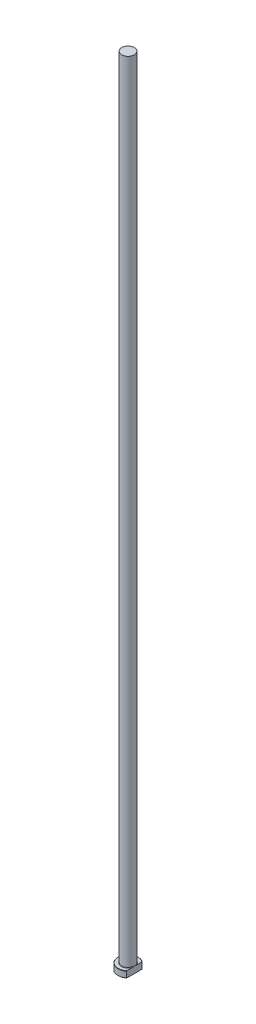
from build123d import *
from build123d.topology import SkipClean

# Parameters (mm, degrees)
CHAMFER1_SIZE = 0.2
FILLET1_R     = 0.3
KEY_DEPTH     = 631.101579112


with BuildPart() as part:
    # Sketch1 → Revolve1 (revolve)
    with BuildSketch(Plane.XY, mode=Mode.PRIVATE) as revolve1_sk:
        Polygon((0, 0), (-8, 0), (-8, 5), (-5, 5), (-5, 630), (0, 630), align=None)
    revolve(revolve1_sk.sketch.rotate(Axis((0, 259.958771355, 0), (0, -1, 0)), 270), axis=Axis((0, 259.958771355, 0), (0, -1, 0)))

    # Chamfer1
    chamfer1_edges = [part.edges().sort_by_distance(p)[0] for p in [
        (0, 5, -8),
        (0, 0, -8),
    ]]
    chamfer(chamfer1_edges, length=CHAMFER1_SIZE)

    # Fillet1
    fillet1_edges = [part.edges().sort_by_distance(p)[0] for p in [
        (0, 5, -5),
    ]]
    fillet(fillet1_edges, radius=FILLET1_R)

    # Sketch2 → KEY (cut, through all)
    with SkipClean():  # the faces are left unmerged after this step: merging them gives an invalid solid
        with BuildSketch(Plane(origin=(0, 0, 0), x_dir=(1, 0, 0), z_dir=(0, 1, 0))):
            with BuildLine():
                Line((5, 6.244997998), (5, -6.244997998))
                ThreePointArc((5, -6.244997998), (8, 0), (5, 6.244997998))
            make_face()
        extrude(amount=KEY_DEPTH, mode=Mode.SUBTRACT)


solid = part.part
